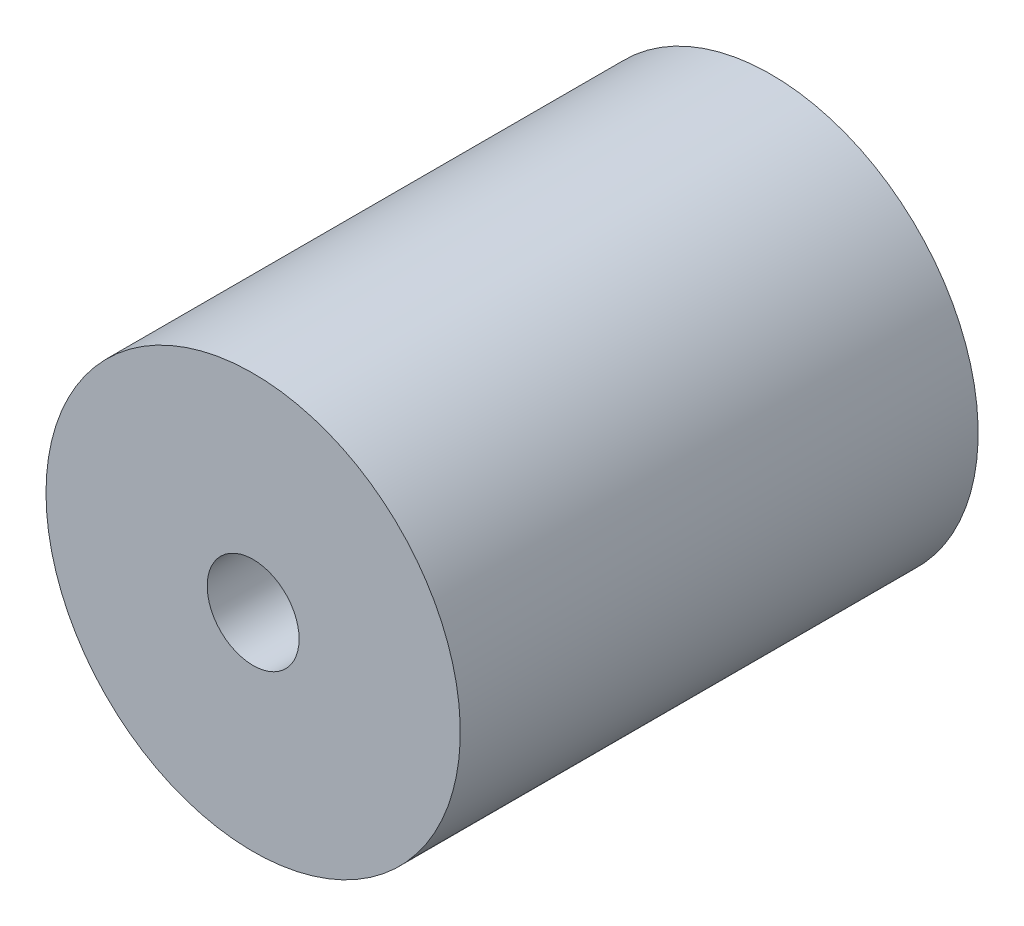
from build123d import *

# Parameters (mm, degrees)
SKETCH1_R                  = 6.096
EXTRUDE1_DEPTH             = 15.24
F_10_32_TAPPED_HOLE1_D     = 4.0386
F_10_32_TAPPED_HOLE1_DEPTH = 7.62
F_10_32_TAPPED_HOLE1_TIP   = 1.213317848


with BuildPart() as part:
    # Sketch1 → Extrude1 (new body)
    with BuildSketch(Plane.XY):
        with Locations(Location((0, 0, 0), (0, 0, 180))):
            Circle(SKETCH1_R)
    extrude(amount=EXTRUDE1_DEPTH)

    # Sketch2 → 6-32 Tapped Hole1 (revolve, cut)
    with BuildSketch(Plane(origin=(0, 0, 15.24), x_dir=(0, -1, 0), z_dir=(1, 0, 0))):
        Polygon((0, 0), (0, 7.16269403), (1.35255, 6.35), (1.35255, 0), align=None)
    revolve(axis=Axis((0, 0, 21.59), (0, 0, -1)), mode=Mode.SUBTRACT)

    # 10-32 Tapped Hole1
    with Locations(Plane(origin=(-1.3164e-05, -2.1722e-05, 0), x_dir=(-1, 0, 0), z_dir=(0, 0, -1))):
        with Locations((0, 0)):
            Hole(F_10_32_TAPPED_HOLE1_D / 2, depth=F_10_32_TAPPED_HOLE1_DEPTH)
            with Locations((0, 0, -(F_10_32_TAPPED_HOLE1_DEPTH + F_10_32_TAPPED_HOLE1_TIP / 2))):  # 118° drill point
                Cone(0, F_10_32_TAPPED_HOLE1_D / 2, F_10_32_TAPPED_HOLE1_TIP, mode=Mode.SUBTRACT)


solid = part.part
